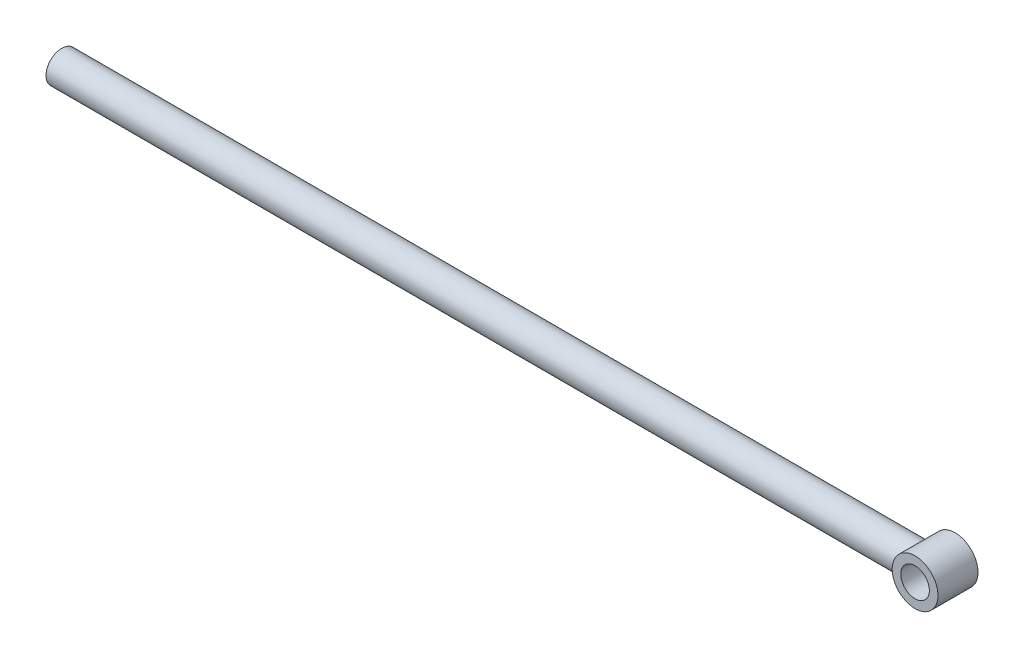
ISO-10303-21;
HEADER;
FILE_DESCRIPTION(('STEP AP214'),'2;1');
FILE_NAME('part.step','',(''),(''),'','','');
FILE_SCHEMA(('AUTOMOTIVE_DESIGN { 1 0 10303 214 1 1 1 1 }'));
ENDSEC;
DATA;
#1=APPLICATION_CONTEXT('core data for automotive mechanical design processes');
#2=APPLICATION_PROTOCOL_DEFINITION('international standard','automotive_design',2000,#1);
#3=PRODUCT_CONTEXT('',#1,'mechanical');
#4=PRODUCT('Part','Part','',(#3));
#5=PRODUCT_RELATED_PRODUCT_CATEGORY('part','',(#4));
#6=PRODUCT_DEFINITION_FORMATION('','',#4);
#7=PRODUCT_DEFINITION_CONTEXT('part definition',#1,'design');
#8=PRODUCT_DEFINITION('design','',#6,#7);
#9=PRODUCT_DEFINITION_SHAPE('','',#8);
#10=(LENGTH_UNIT() NAMED_UNIT(*) SI_UNIT(.MILLI.,.METRE.));
#11=(NAMED_UNIT(*) PLANE_ANGLE_UNIT() SI_UNIT($,.RADIAN.));
#12=(NAMED_UNIT(*) SI_UNIT($,.STERADIAN.) SOLID_ANGLE_UNIT());
#13=UNCERTAINTY_MEASURE_WITH_UNIT(LENGTH_MEASURE(1.E-05),#10,'distance_accuracy_value','');
#14=(GEOMETRIC_REPRESENTATION_CONTEXT(3) GLOBAL_UNCERTAINTY_ASSIGNED_CONTEXT((#13)) GLOBAL_UNIT_ASSIGNED_CONTEXT((#10,
#11,#12)) REPRESENTATION_CONTEXT('',''));
#15=CARTESIAN_POINT('',(0.,0.,0.));
#16=DIRECTION('',(0.,0.,1.));
#17=DIRECTION('',(1.,0.,0.));
#18=AXIS2_PLACEMENT_3D('',#15,#16,#17);
#19=CARTESIAN_POINT('',(282.839330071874,0.,14.));
#20=DIRECTION('',(0.,0.,-1.));
#21=DIRECTION('',(-1.,0.,0.));
#22=AXIS2_PLACEMENT_3D('',#19,#20,#21);
#23=CYLINDRICAL_SURFACE('',#22,7.99999999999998);
#24=CARTESIAN_POINT('',(282.839330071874,0.,0.));
#25=DIRECTION('',(0.,0.,1.));
#26=DIRECTION('',(1.,0.,0.));
#27=AXIS2_PLACEMENT_3D('',#24,#25,#26);
#28=CIRCLE('',#27,7.99999999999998);
#29=CARTESIAN_POINT('',(290.839330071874,0.,0.));
#30=VERTEX_POINT('',#29);
#31=EDGE_CURVE('E48',#30,#30,#28,.T.);
#32=ORIENTED_EDGE('',*,*,#31,.T.);
#33=EDGE_LOOP('',(#32));
#34=FACE_BOUND('',#33,.T.);
#35=CARTESIAN_POINT('',(282.839330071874,0.,14.));
#36=DIRECTION('',(0.,0.,1.));
#37=DIRECTION('',(1.,0.,0.));
#38=AXIS2_PLACEMENT_3D('',#35,#36,#37);
#39=CIRCLE('',#38,7.99999999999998);
#40=CARTESIAN_POINT('',(290.839330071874,0.,14.));
#41=VERTEX_POINT('',#40);
#42=EDGE_CURVE('E44',#41,#41,#39,.T.);
#43=ORIENTED_EDGE('',*,*,#42,.F.);
#44=EDGE_LOOP('',(#43));
#45=FACE_BOUND('',#44,.T.);
#46=CARTESIAN_POINT('',(274.839330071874,0.,12.5));
#47=CARTESIAN_POINT('',(274.839330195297,0.137266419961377,12.4999998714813));
#48=CARTESIAN_POINT('',(274.842870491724,0.274534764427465,12.4948541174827));
#49=CARTESIAN_POINT('',(274.85694332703,0.547943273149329,12.4743541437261));
#50=CARTESIAN_POINT('',(274.867475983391,0.68408341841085,12.4589997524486));
#51=CARTESIAN_POINT('',(274.895278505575,0.954192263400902,12.4183185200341));
#52=CARTESIAN_POINT('',(274.912549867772,1.08816047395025,12.3929894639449));
#53=CARTESIAN_POINT('',(274.953430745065,1.35297984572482,12.3327195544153));
#54=CARTESIAN_POINT('',(274.977042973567,1.48382964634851,12.2977745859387));
#55=CARTESIAN_POINT('',(275.029937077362,1.74083213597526,12.2189528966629));
#56=CARTESIAN_POINT('',(275.059187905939,1.86700623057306,12.1751250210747));
#57=CARTESIAN_POINT('',(275.12283654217,2.11473737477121,12.0789335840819));
#58=CARTESIAN_POINT('',(275.157236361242,2.23629259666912,12.0265666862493));
#59=CARTESIAN_POINT('',(275.267159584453,2.59307020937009,11.8574841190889));
#60=CARTESIAN_POINT('',(275.349454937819,2.82063002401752,11.7287162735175));
#61=CARTESIAN_POINT('',(275.534053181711,3.27066804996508,11.4307937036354));
#62=CARTESIAN_POINT('',(275.637474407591,3.49097725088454,11.2590981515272));
#63=CARTESIAN_POINT('',(275.851503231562,3.90178342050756,10.8862741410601));
#64=CARTESIAN_POINT('',(275.962121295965,4.092235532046,10.685102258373));
#65=CARTESIAN_POINT('',(276.136364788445,4.36862185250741,10.3453353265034));
#66=CARTESIAN_POINT('',(276.200442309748,4.46513198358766,10.2154145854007));
#67=CARTESIAN_POINT('',(276.326329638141,4.64682921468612,9.94674113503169));
#68=CARTESIAN_POINT('',(276.388138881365,4.73201351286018,9.80798625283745));
#69=CARTESIAN_POINT('',(276.507287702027,4.89030116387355,9.52221640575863));
#70=CARTESIAN_POINT('',(276.564634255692,4.96342358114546,9.37521497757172));
#71=CARTESIAN_POINT('',(276.67262305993,5.09696884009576,9.07321219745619));
#72=CARTESIAN_POINT('',(276.723265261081,5.15739158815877,8.91821078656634));
#73=CARTESIAN_POINT('',(276.833338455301,5.28562320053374,8.53832815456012));
#74=CARTESIAN_POINT('',(276.888428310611,5.34703685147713,8.30987963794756));
#75=CARTESIAN_POINT('',(276.952244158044,5.4169353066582,7.95969894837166));
#76=CARTESIAN_POINT('',(276.970376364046,5.43652795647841,7.84176605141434));
#77=CARTESIAN_POINT('',(276.999725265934,5.46804253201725,7.60403562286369));
#78=CARTESIAN_POINT('',(277.010944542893,5.4799673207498,7.48423880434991));
#79=CARTESIAN_POINT('',(277.026027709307,5.49596558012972,7.24301453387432));
#80=CARTESIAN_POINT('',(277.029851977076,5.49999675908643,7.12158178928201));
#81=CARTESIAN_POINT('',(277.029858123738,5.50000323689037,6.87871571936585));
#82=CARTESIAN_POINT('',(277.02604000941,5.49597854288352,6.7572823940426));
#83=CARTESIAN_POINT('',(277.010925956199,5.47994768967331,6.51536395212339));
#84=CARTESIAN_POINT('',(276.999626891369,5.46793819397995,6.39487925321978));
#85=CARTESIAN_POINT('',(276.970038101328,5.43616344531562,6.15578729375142));
#86=CARTESIAN_POINT('',(276.951745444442,5.41639493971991,6.037180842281));
#87=CARTESIAN_POINT('',(276.889904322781,5.34864197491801,5.69895690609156));
#88=CARTESIAN_POINT('',(276.838318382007,5.29115689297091,5.48263542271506));
#89=CARTESIAN_POINT('',(276.718678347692,5.15227529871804,5.06269754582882));
#90=CARTESIAN_POINT('',(276.650611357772,5.07086005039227,4.85909125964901));
#91=CARTESIAN_POINT('',(276.522075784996,4.90919386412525,4.51474325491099));
#92=CARTESIAN_POINT('',(276.463886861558,4.83362805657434,4.37090126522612));
#93=CARTESIAN_POINT('',(276.34372452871,4.6709026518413,4.09159965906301));
#94=CARTESIAN_POINT('',(276.281751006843,4.58374271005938,3.95614029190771));
#95=CARTESIAN_POINT('',(276.155880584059,4.39819265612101,3.69367568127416));
#96=CARTESIAN_POINT('',(276.091980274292,4.29978166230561,3.56668687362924));
#97=CARTESIAN_POINT('',(275.964145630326,4.09227177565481,3.32181264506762));
#98=CARTESIAN_POINT('',(275.900211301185,3.98317417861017,3.20392612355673));
#99=CARTESIAN_POINT('',(275.773298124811,3.75347594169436,2.97659515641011));
#100=CARTESIAN_POINT('',(275.710335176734,3.63277138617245,2.86724668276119));
#101=CARTESIAN_POINT('',(275.587618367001,3.38116315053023,2.65898660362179));
#102=CARTESIAN_POINT('',(275.52786411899,3.25026070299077,2.56007374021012));
#103=CARTESIAN_POINT('',(275.413184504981,2.97892919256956,2.37365947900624));
#104=CARTESIAN_POINT('',(275.35825115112,2.83851659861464,2.28613908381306));
#105=CARTESIAN_POINT('',(275.254595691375,2.54862267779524,2.12330668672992));
#106=CARTESIAN_POINT('',(275.205871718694,2.39914409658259,2.04799101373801));
#107=CARTESIAN_POINT('',(275.126017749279,2.12610532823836,1.92586785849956));
#108=CARTESIAN_POINT('',(275.093382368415,2.00414979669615,1.87644239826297));
#109=CARTESIAN_POINT('',(275.033357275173,1.75587264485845,1.7861386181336));
#110=CARTESIAN_POINT('',(275.00596642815,1.62955197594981,1.74525844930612));
#111=CARTESIAN_POINT('',(274.957002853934,1.37329013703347,1.67254238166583));
#112=CARTESIAN_POINT('',(274.9354274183,1.24335068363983,1.64070227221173));
#113=CARTESIAN_POINT('',(274.898551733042,0.980628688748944,1.58646542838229));
#114=CARTESIAN_POINT('',(274.883251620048,0.84784608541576,1.56406889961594));
#115=CARTESIAN_POINT('',(274.859238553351,0.579909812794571,1.52898316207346));
#116=CARTESIAN_POINT('',(274.850549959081,0.4447492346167,1.51632984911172));
#117=CARTESIAN_POINT('',(274.840063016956,0.17359352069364,1.50106334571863));
#118=CARTESIAN_POINT('',(274.838264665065,0.0375983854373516,1.49845014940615));
#119=CARTESIAN_POINT('',(274.841602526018,-0.234128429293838,1.50330562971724));
#120=CARTESIAN_POINT('',(274.846738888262,-0.369860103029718,1.51077452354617));
#121=CARTESIAN_POINT('',(274.863820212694,-0.639966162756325,1.5356757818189));
#122=CARTESIAN_POINT('',(274.875764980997,-0.774340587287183,1.55310786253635));
#123=CARTESIAN_POINT('',(274.905298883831,-1.03300361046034,1.59638208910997));
#124=CARTESIAN_POINT('',(274.922521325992,-1.15742582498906,1.62167909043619));
#125=CARTESIAN_POINT('',(274.962403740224,-1.40342019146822,1.68056097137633));
#126=CARTESIAN_POINT('',(274.98506556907,-1.52499135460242,1.71414868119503));
#127=CARTESIAN_POINT('',(275.060570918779,-1.88431514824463,1.82677631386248));
#128=CARTESIAN_POINT('',(275.120958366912,-2.11688002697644,1.91771526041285));
#129=CARTESIAN_POINT('',(275.262890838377,-2.58089638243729,2.13586426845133));
#130=CARTESIAN_POINT('',(275.345708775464,-2.81087757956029,2.26533144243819));
#131=CARTESIAN_POINT('',(275.524017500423,-3.24680165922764,2.55291914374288));
#132=CARTESIAN_POINT('',(275.619517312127,-3.45272722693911,2.71106010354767));
#133=CARTESIAN_POINT('',(275.833825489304,-3.87132112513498,3.08161103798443));
#134=CARTESIAN_POINT('',(275.953844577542,-4.07924157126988,3.29867588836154));
#135=CARTESIAN_POINT('',(276.192591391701,-4.45767290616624,3.76438738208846));
#136=CARTESIAN_POINT('',(276.311318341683,-4.62816238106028,4.01305197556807));
#137=CARTESIAN_POINT('',(276.471889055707,-4.84380627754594,4.39133987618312));
#138=CARTESIAN_POINT('',(276.519440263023,-4.90554891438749,4.50932030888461));
#139=CARTESIAN_POINT('',(276.610634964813,-5.02083091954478,4.75074473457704));
#140=CARTESIAN_POINT('',(276.654278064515,-5.07436945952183,4.87418927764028));
#141=CARTESIAN_POINT('',(276.736244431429,-5.172662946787,5.12601986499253));
#142=CARTESIAN_POINT('',(276.77457543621,-5.21743070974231,5.25439836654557));
#143=CARTESIAN_POINT('',(276.844564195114,-5.29769958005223,5.51573553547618));
#144=CARTESIAN_POINT('',(276.87622616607,-5.33320654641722,5.64869124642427));
#145=CARTESIAN_POINT('',(276.926600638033,-5.38894978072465,5.89448821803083));
#146=CARTESIAN_POINT('',(276.946614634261,-5.41077870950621,6.00670265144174));
#147=CARTESIAN_POINT('',(276.98052766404,-5.447482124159,6.23313494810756));
#148=CARTESIAN_POINT('',(276.994429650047,-5.46235996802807,6.34735181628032));
#149=CARTESIAN_POINT('',(277.015599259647,-5.48492486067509,6.57702980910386));
#150=CARTESIAN_POINT('',(277.02287151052,-5.49261692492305,6.69249000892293));
#151=CARTESIAN_POINT('',(277.03050764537,-5.5006920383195,6.92389815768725));
#152=CARTESIAN_POINT('',(277.030871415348,-5.50107496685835,7.03984611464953));
#153=CARTESIAN_POINT('',(277.024672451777,-5.49452269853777,7.27133226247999));
#154=CARTESIAN_POINT('',(277.018110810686,-5.48758865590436,7.38687051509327));
#155=CARTESIAN_POINT('',(276.998336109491,-5.46653306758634,7.61673163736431));
#156=CARTESIAN_POINT('',(276.985120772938,-5.45240906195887,7.73105407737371));
#157=CARTESIAN_POINT('',(276.936169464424,-5.39954564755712,8.07121415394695));
#158=CARTESIAN_POINT('',(276.891131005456,-5.35031745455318,8.29416045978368));
#159=CARTESIAN_POINT('',(276.76522454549,-5.20736893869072,8.79455097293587));
#160=CARTESIAN_POINT('',(276.677598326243,-5.10462333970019,9.06767940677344));
#161=CARTESIAN_POINT('',(276.532246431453,-4.92207151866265,9.45845126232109));
#162=CARTESIAN_POINT('',(276.481410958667,-4.85639062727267,9.58568962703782));
#163=CARTESIAN_POINT('',(276.376572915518,-4.71597898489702,9.83369594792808));
#164=CARTESIAN_POINT('',(276.322570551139,-4.6412488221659,9.95446432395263));
#165=CARTESIAN_POINT('',(276.155534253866,-4.40061245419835,10.3118378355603));
#166=CARTESIAN_POINT('',(276.039615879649,-4.22083124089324,10.5380376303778));
#167=CARTESIAN_POINT('',(275.867970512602,-3.92596286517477,10.8545596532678));
#168=CARTESIAN_POINT('',(275.811101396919,-3.82342021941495,10.9563128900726));
#169=CARTESIAN_POINT('',(275.699160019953,-3.61004986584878,11.1519250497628));
#170=CARTESIAN_POINT('',(275.644088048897,-3.49922082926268,11.2457827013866));
#171=CARTESIAN_POINT('',(275.528948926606,-3.25261212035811,11.4382955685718));
#172=CARTESIAN_POINT('',(275.469345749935,-3.11556524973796,11.5356111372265));
#173=CARTESIAN_POINT('',(275.355636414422,-2.83155594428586,11.7181313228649));
#174=CARTESIAN_POINT('',(275.301527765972,-2.68459805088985,11.8033414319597));
#175=CARTESIAN_POINT('',(275.200402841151,-2.38165111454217,11.960526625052));
#176=CARTESIAN_POINT('',(275.153378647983,-2.22567242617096,12.0325165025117));
#177=CARTESIAN_POINT('',(275.067852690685,-1.90565844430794,12.1621931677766));
#178=CARTESIAN_POINT('',(275.029347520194,-1.74162640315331,12.2198856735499));
#179=CARTESIAN_POINT('',(274.970465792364,-1.44828258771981,12.3075226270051));
#180=CARTESIAN_POINT('',(274.947960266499,-1.32038319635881,12.3408013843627));
#181=CARTESIAN_POINT('',(274.909008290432,-1.06164857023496,12.3981894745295));
#182=CARTESIAN_POINT('',(274.892560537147,-0.930813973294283,12.4223007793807));
#183=CARTESIAN_POINT('',(274.866098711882,-0.667175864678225,12.4610088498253));
#184=CARTESIAN_POINT('',(274.856080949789,-0.534373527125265,12.4756110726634));
#185=CARTESIAN_POINT('',(274.842696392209,-0.267714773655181,12.4951069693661));
#186=CARTESIAN_POINT('',(274.839329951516,-0.133858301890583,12.5000001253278));
#187=CARTESIAN_POINT('',(274.839330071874,0.,12.5));
#188=B_SPLINE_CURVE_WITH_KNOTS('',3,(#46,#47,#48,#49,#50,#51,#52,#53,#54,#55,#56,#57,#58,#59,
#60,#61,#62,#63,#64,#65,#66,#67,#68,#69,#70,#71,#72,#73,#74,#75,#76,#77,#78,#79,#80,#81,#82,#83,
#84,#85,#86,#87,#88,#89,#90,#91,#92,#93,#94,#95,#96,#97,#98,#99,#100,#101,#102,#103,#104,#105,
#106,#107,#108,#109,#110,#111,#112,#113,#114,#115,#116,#117,#118,#119,#120,#121,#122,#123,#124,
#125,#126,#127,#128,#129,#130,#131,#132,#133,#134,#135,#136,#137,#138,#139,#140,#141,#142,#143,
#144,#145,#146,#147,#148,#149,#150,#151,#152,#153,#154,#155,#156,#157,#158,#159,#160,#161,#162,
#163,#164,#165,#166,#167,#168,#169,#170,#171,#172,#173,#174,#175,#176,#177,#178,#179,#180,#181,
#182,#183,#184,#185,#186,#187),.UNSPECIFIED.,.T.,.F.,(4,2,2,2,2,2,2,2,2,2,2,2,2,2,2,2,2,2,2,2,2,
2,2,2,2,2,2,2,2,2,2,2,2,2,2,2,2,2,2,2,2,2,2,2,2,2,2,2,2,2,2,2,2,2,2,2,2,2,2,2,2,2,2,2,2,2,2,2,2,
2,4),(0.,0.411661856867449,0.823330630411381,1.23509086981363,1.64702759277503,2.05675779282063,
2.46664847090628,3.2857146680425,4.17612227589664,5.0678550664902,5.58954551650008,
6.11136478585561,6.63235122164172,7.15334149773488,7.87863512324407,8.24101211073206,
8.60325371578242,8.96743085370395,9.33160766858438,9.6959367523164,10.060418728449,
10.7467806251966,11.4336813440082,11.9508182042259,12.4679704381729,12.986098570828,
13.5041639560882,14.0273986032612,14.5505701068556,15.072857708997,15.5949879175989,
16.0013132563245,16.4075505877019,16.8135983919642,17.2196550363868,17.6272006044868,
18.034745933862,18.442300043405,18.8498425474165,19.2337976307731,19.6178839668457,
20.3854447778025,21.2122255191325,22.0395977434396,23.0068744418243,23.9747030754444,
24.3985827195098,24.8225051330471,25.2458034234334,25.6688332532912,26.0166473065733,
26.3642931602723,26.7116961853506,27.0591049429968,27.4064589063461,27.753931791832,
28.4491268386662,29.3580346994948,29.8135308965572,30.268997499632,31.1989975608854,
31.6644323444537,32.1299419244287,32.6642217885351,33.1982584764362,33.731693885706,
34.2649156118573,34.6666522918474,35.0683025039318,35.4697220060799,35.8711629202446),.UNSPECIFIED.);
#189=CARTESIAN_POINT('',(274.839330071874,0.,12.5));
#190=VERTEX_POINT('',#189);
#191=EDGE_CURVE('E40',#190,#190,#188,.T.);
#192=ORIENTED_EDGE('',*,*,#191,.F.);
#193=EDGE_LOOP('',(#192));
#194=FACE_BOUND('',#193,.T.);
#195=ADVANCED_FACE('F29',(#34,#45,#194),#23,.T.);
#196=CARTESIAN_POINT('',(282.839330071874,0.,14.));
#197=DIRECTION('',(0.,0.,1.));
#198=DIRECTION('',(1.,0.,0.));
#199=AXIS2_PLACEMENT_3D('',#196,#197,#198);
#200=PLANE('',#199);
#201=ORIENTED_EDGE('',*,*,#42,.T.);
#202=EDGE_LOOP('',(#201));
#203=FACE_BOUND('',#202,.T.);
#204=CARTESIAN_POINT('',(282.839330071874,0.,14.));
#205=DIRECTION('',(0.,0.,1.));
#206=DIRECTION('',(1.,0.,0.));
#207=AXIS2_PLACEMENT_3D('',#204,#205,#206);
#208=CIRCLE('',#207,4.99999999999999);
#209=CARTESIAN_POINT('',(287.839330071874,0.,14.));
#210=VERTEX_POINT('',#209);
#211=EDGE_CURVE('E138',#210,#210,#208,.T.);
#212=ORIENTED_EDGE('',*,*,#211,.F.);
#213=EDGE_LOOP('',(#212));
#214=FACE_BOUND('',#213,.T.);
#215=ADVANCED_FACE('F72',(#203,#214),#200,.T.);
#216=CARTESIAN_POINT('',(282.839330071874,0.,0.));
#217=DIRECTION('',(0.,0.,1.));
#218=DIRECTION('',(1.,0.,0.));
#219=AXIS2_PLACEMENT_3D('',#216,#217,#218);
#220=PLANE('',#219);
#221=ORIENTED_EDGE('',*,*,#31,.F.);
#222=EDGE_LOOP('',(#221));
#223=FACE_BOUND('',#222,.T.);
#224=CARTESIAN_POINT('',(282.839330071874,0.,0.));
#225=DIRECTION('',(0.,0.,1.));
#226=DIRECTION('',(1.,0.,0.));
#227=AXIS2_PLACEMENT_3D('',#224,#225,#226);
#228=CIRCLE('',#227,4.99999999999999);
#229=CARTESIAN_POINT('',(287.839330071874,0.,0.));
#230=VERTEX_POINT('',#229);
#231=EDGE_CURVE('E139',#230,#230,#228,.T.);
#232=ORIENTED_EDGE('',*,*,#231,.T.);
#233=EDGE_LOOP('',(#232));
#234=FACE_BOUND('',#233,.T.);
#235=ADVANCED_FACE('F70',(#223,#234),#220,.F.);
#236=CARTESIAN_POINT('',(282.839330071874,0.,14.));
#237=DIRECTION('',(0.,0.,-1.));
#238=DIRECTION('',(-1.,0.,0.));
#239=AXIS2_PLACEMENT_3D('',#236,#237,#238);
#240=CYLINDRICAL_SURFACE('',#239,4.99999999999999);
#241=ORIENTED_EDGE('',*,*,#211,.T.);
#242=EDGE_LOOP('',(#241));
#243=FACE_BOUND('',#242,.T.);
#244=ORIENTED_EDGE('',*,*,#231,.F.);
#245=EDGE_LOOP('',(#244));
#246=FACE_BOUND('',#245,.T.);
#247=ADVANCED_FACE('F63',(#243,#246),#240,.F.);
#248=CARTESIAN_POINT('',(-116.634609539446,0.,7.));
#249=DIRECTION('',(-1.,0.,0.));
#250=DIRECTION('',(0.,0.,1.));
#251=AXIS2_PLACEMENT_3D('',#248,#249,#250);
#252=CYLINDRICAL_SURFACE('',#251,2.5);
#253=CARTESIAN_POINT('',(-22.5465333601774,0.,7.));
#254=DIRECTION('',(-1.,0.,0.));
#255=DIRECTION('',(0.,0.,1.));
#256=AXIS2_PLACEMENT_3D('',#253,#254,#255);
#257=CIRCLE('',#256,2.5);
#258=CARTESIAN_POINT('',(-22.5465333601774,0.,9.5));
#259=VERTEX_POINT('',#258);
#260=EDGE_CURVE('E142',#259,#259,#257,.T.);
#261=ORIENTED_EDGE('',*,*,#260,.T.);
#262=EDGE_LOOP('',(#261));
#263=FACE_BOUND('',#262,.T.);
#264=CARTESIAN_POINT('',(274.839330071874,0.,9.5));
#265=CARTESIAN_POINT('',(274.839330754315,-0.136878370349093,9.49999910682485));
#266=CARTESIAN_POINT('',(274.842876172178,-0.273766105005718,9.48872154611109));
#267=CARTESIAN_POINT('',(274.856672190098,-0.543538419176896,9.44402751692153));
#268=CARTESIAN_POINT('',(274.866924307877,-0.676422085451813,9.41060603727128));
#269=CARTESIAN_POINT('',(274.893013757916,-0.93425708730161,9.32286125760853));
#270=CARTESIAN_POINT('',(274.908842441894,-1.0592203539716,9.26857031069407));
#271=CARTESIAN_POINT('',(274.944450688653,-1.29826960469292,9.14076536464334));
#272=CARTESIAN_POINT('',(274.964230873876,-1.41235387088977,9.06724833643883));
#273=CARTESIAN_POINT('',(275.006325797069,-1.62993066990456,8.90068801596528));
#274=CARTESIAN_POINT('',(275.028695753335,-1.73304005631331,8.80715822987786));
#275=CARTESIAN_POINT('',(275.07312914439,-1.92239476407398,8.60426321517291));
#276=CARTESIAN_POINT('',(275.095192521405,-2.00863694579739,8.49489504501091));
#277=CARTESIAN_POINT('',(275.137107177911,-2.16388672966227,8.26011087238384));
#278=CARTESIAN_POINT('',(275.156890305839,-2.23241568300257,8.13436504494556));
#279=CARTESIAN_POINT('',(275.19117403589,-2.34719482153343,7.87241537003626));
#280=CARTESIAN_POINT('',(275.205676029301,-2.39345087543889,7.73621428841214));
#281=CARTESIAN_POINT('',(275.227177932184,-2.46096919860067,7.46154384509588));
#282=CARTESIAN_POINT('',(275.234390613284,-2.48294220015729,7.3232663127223));
#283=CARTESIAN_POINT('',(275.241128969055,-2.50349110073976,7.04481376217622));
#284=CARTESIAN_POINT('',(275.240656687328,-2.50207321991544,6.90463925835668));
#285=CARTESIAN_POINT('',(275.232266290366,-2.47643649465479,6.63225107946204));
#286=CARTESIAN_POINT('',(275.224643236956,-2.45312115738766,6.49994174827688));
#287=CARTESIAN_POINT('',(275.203289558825,-2.38581626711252,6.24121568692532));
#288=CARTESIAN_POINT('',(275.189558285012,-2.34182451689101,6.11479958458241));
#289=CARTESIAN_POINT('',(275.157309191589,-2.23377749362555,5.86929611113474));
#290=CARTESIAN_POINT('',(275.138724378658,-2.16943851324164,5.75034277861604));
#291=CARTESIAN_POINT('',(275.098892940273,-2.02272041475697,5.52462446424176));
#292=CARTESIAN_POINT('',(275.077645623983,-1.94033661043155,5.41786265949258));
#293=CARTESIAN_POINT('',(275.033699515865,-1.75543390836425,5.21445011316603));
#294=CARTESIAN_POINT('',(275.010978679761,-1.65216914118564,5.11848088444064));
#295=CARTESIAN_POINT('',(274.967498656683,-1.43072881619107,4.94505621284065));
#296=CARTESIAN_POINT('',(274.946739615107,-1.31255215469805,4.86760214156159));
#297=CARTESIAN_POINT('',(274.909304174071,-1.06332922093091,4.73294462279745));
#298=CARTESIAN_POINT('',(274.89266085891,-0.932189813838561,4.67590372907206));
#299=CARTESIAN_POINT('',(274.865570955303,-0.66153595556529,4.58489399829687));
#300=CARTESIAN_POINT('',(274.855122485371,-0.522024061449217,4.55091815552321));
#301=CARTESIAN_POINT('',(274.841902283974,-0.244370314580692,4.50816391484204));
#302=CARTESIAN_POINT('',(274.838849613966,-0.10638369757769,4.49846291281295));
#303=CARTESIAN_POINT('',(274.839934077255,0.169260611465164,4.50193245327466));
#304=CARTESIAN_POINT('',(274.844070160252,0.306918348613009,4.51509965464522));
#305=CARTESIAN_POINT('',(274.858882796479,0.57443866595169,4.56319118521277));
#306=CARTESIAN_POINT('',(274.869394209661,0.704409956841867,4.59756653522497));
#307=CARTESIAN_POINT('',(274.895727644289,0.956703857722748,4.68642870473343));
#308=CARTESIAN_POINT('',(274.911550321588,1.07902552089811,4.74091800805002));
#309=CARTESIAN_POINT('',(274.947359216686,1.31586481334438,4.86994643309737));
#310=CARTESIAN_POINT('',(274.967437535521,1.43011947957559,4.94494197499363));
#311=CARTESIAN_POINT('',(275.009461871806,1.64473170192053,5.11230642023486));
#312=CARTESIAN_POINT('',(275.031408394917,1.7450854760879,5.20468003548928));
#313=CARTESIAN_POINT('',(275.075790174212,1.93317492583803,5.40851778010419));
#314=CARTESIAN_POINT('',(275.098210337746,2.02025304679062,5.52059332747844));
#315=CARTESIAN_POINT('',(275.140091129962,2.17442500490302,5.75825323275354));
#316=CARTESIAN_POINT('',(275.159551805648,2.24151915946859,5.88383737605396));
#317=CARTESIAN_POINT('',(275.193094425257,2.35340166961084,6.14469034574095));
#318=CARTESIAN_POINT('',(275.207197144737,2.39827639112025,6.27991929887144));
#319=CARTESIAN_POINT('',(275.228306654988,2.4644578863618,6.55654498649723));
#320=CARTESIAN_POINT('',(275.23531614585,2.48577362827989,6.69793935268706));
#321=CARTESIAN_POINT('',(275.241164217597,2.50358812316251,6.97600817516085));
#322=CARTESIAN_POINT('',(275.240357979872,2.50116559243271,7.11260690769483));
#323=CARTESIAN_POINT('',(275.231528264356,2.47417636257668,7.38334916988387));
#324=CARTESIAN_POINT('',(275.223505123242,2.44961069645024,7.51749281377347));
#325=CARTESIAN_POINT('',(275.201393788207,2.37975459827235,7.77758807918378));
#326=CARTESIAN_POINT('',(275.187396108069,2.33477284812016,7.90363088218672));
#327=CARTESIAN_POINT('',(275.154935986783,2.22560454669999,8.14648082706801));
#328=CARTESIAN_POINT('',(275.136472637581,2.16141408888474,8.2632860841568));
#329=CARTESIAN_POINT('',(275.096260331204,2.01271350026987,8.48929194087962));
#330=CARTESIAN_POINT('',(275.074411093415,1.92750667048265,8.59801625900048));
#331=CARTESIAN_POINT('',(275.03035009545,1.7404179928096,8.799972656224));
#332=CARTESIAN_POINT('',(275.008138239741,1.63853168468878,8.89320057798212));
#333=CARTESIAN_POINT('',(274.964984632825,1.4169733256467,9.06456507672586));
#334=CARTESIAN_POINT('',(274.944108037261,1.29682914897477,9.1421094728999));
#335=CARTESIAN_POINT('',(274.906794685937,1.0445582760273,9.27579783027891));
#336=CARTESIAN_POINT('',(274.890356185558,0.912436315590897,9.33195020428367));
#337=CARTESIAN_POINT('',(274.864917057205,0.651495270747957,9.41718273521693));
#338=CARTESIAN_POINT('',(274.855405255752,0.523340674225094,9.44814973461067));
#339=CARTESIAN_POINT('',(274.842612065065,0.263459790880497,9.48955671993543));
#340=CARTESIAN_POINT('',(274.839329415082,0.13173423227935,9.50000085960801));
#341=CARTESIAN_POINT('',(274.839330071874,0.,9.5));
#342=B_SPLINE_CURVE_WITH_KNOTS('',3,(#264,#265,#266,#267,#268,#269,#270,#271,#272,#273,#274,
#275,#276,#277,#278,#279,#280,#281,#282,#283,#284,#285,#286,#287,#288,#289,#290,#291,#292,#293,
#294,#295,#296,#297,#298,#299,#300,#301,#302,#303,#304,#305,#306,#307,#308,#309,#310,#311,#312,
#313,#314,#315,#316,#317,#318,#319,#320,#321,#322,#323,#324,#325,#326,#327,#328,#329,#330,#331,
#332,#333,#334,#335,#336,#337,#338,#339,#340,#341),.UNSPECIFIED.,.T.,.F.,(4,2,2,2,2,2,2,2,2,2,2,
2,2,2,2,2,2,2,2,2,2,2,2,2,2,2,2,2,2,2,2,2,2,2,2,2,2,2,4),(0.,0.410150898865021,0.82039464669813,
1.23000495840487,1.63967984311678,2.06075644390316,2.48191134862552,2.91347542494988,
3.34492572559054,3.7633830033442,4.18172900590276,4.58353834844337,4.98539039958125,
5.3931128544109,5.80094132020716,6.22733494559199,6.65376014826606,7.08350921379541,
7.51312768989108,7.92615137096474,8.33911471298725,8.74181253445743,9.14456010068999,
9.55712649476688,9.96980491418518,10.3988355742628,10.8278594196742,11.2552023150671,
11.6823824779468,12.0902440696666,12.4980866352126,12.8999582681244,13.3019116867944,
13.7195902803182,14.1373807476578,14.5688133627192,15.0000761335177,15.3948927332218,
15.7896294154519),.UNSPECIFIED.);
#343=CARTESIAN_POINT('',(274.839330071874,0.,9.5));
#344=VERTEX_POINT('',#343);
#345=EDGE_CURVE('E10',#344,#344,#342,.T.);
#346=ORIENTED_EDGE('',*,*,#345,.T.);
#347=EDGE_LOOP('',(#346));
#348=FACE_BOUND('',#347,.T.);
#349=ADVANCED_FACE('F58',(#263,#348),#252,.F.);
#350=CARTESIAN_POINT('',(-116.634609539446,0.,7.));
#351=DIRECTION('',(-1.,0.,0.));
#352=DIRECTION('',(0.,0.,1.));
#353=AXIS2_PLACEMENT_3D('',#350,#351,#352);
#354=CYLINDRICAL_SURFACE('',#353,5.5);
#355=CARTESIAN_POINT('',(-22.5465333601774,0.,7.));
#356=DIRECTION('',(-1.,0.,0.));
#357=DIRECTION('',(0.,0.,1.));
#358=AXIS2_PLACEMENT_3D('',#355,#356,#357);
#359=CIRCLE('',#358,5.5);
#360=CARTESIAN_POINT('',(-22.5465333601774,0.,12.5));
#361=VERTEX_POINT('',#360);
#362=EDGE_CURVE('E147',#361,#361,#359,.T.);
#363=ORIENTED_EDGE('',*,*,#362,.F.);
#364=EDGE_LOOP('',(#363));
#365=FACE_BOUND('',#364,.T.);
#366=ORIENTED_EDGE('',*,*,#191,.T.);
#367=EDGE_LOOP('',(#366));
#368=FACE_BOUND('',#367,.T.);
#369=ADVANCED_FACE('F54',(#365,#368),#354,.T.);
#370=CARTESIAN_POINT('',(-22.5465333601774,0.,1.5));
#371=DIRECTION('',(1.,0.,0.));
#372=DIRECTION('',(0.,0.,-1.));
#373=AXIS2_PLACEMENT_3D('',#370,#371,#372);
#374=PLANE('',#373);
#375=ORIENTED_EDGE('',*,*,#260,.F.);
#376=EDGE_LOOP('',(#375));
#377=FACE_BOUND('',#376,.T.);
#378=ORIENTED_EDGE('',*,*,#362,.T.);
#379=EDGE_LOOP('',(#378));
#380=FACE_BOUND('',#379,.T.);
#381=ADVANCED_FACE('F57',(#377,#380),#374,.F.);
#382=ORIENTED_EDGE('',*,*,#345,.F.);
#383=EDGE_LOOP('',(#382));
#384=FACE_BOUND('',#383,.T.);
#385=ADVANCED_FACE('F31',(#384),#23,.T.);
#386=CLOSED_SHELL('',(#195,#215,#235,#247,#349,#369,#381,#385));
#387=MANIFOLD_SOLID_BREP('B2',#386);
#388=ADVANCED_BREP_SHAPE_REPRESENTATION('',(#18,#387),#14);
#389=SHAPE_DEFINITION_REPRESENTATION(#9,#388);
ENDSEC;
END-ISO-10303-21;
